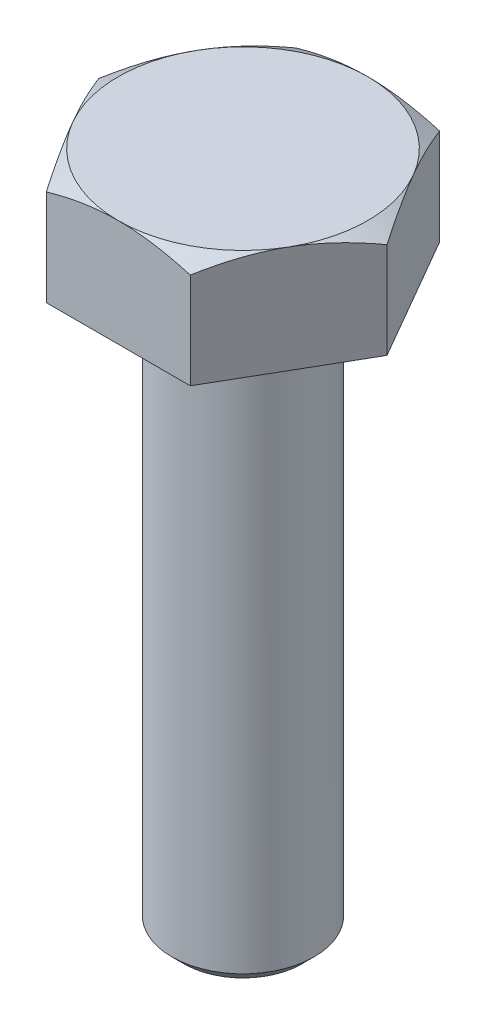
from build123d import *

# Parameters (mm, degrees)
BOSS_EXTRUDE1_DEPTH = 4.7752
SKETCH2_OUTSIDE_W   = 34.918
SKETCH2_OUTSIDE_H   = 33.198
SKETCH2_OUTSIDE_R   = 5.5626
CUT_EXTRUDE1_DEPTH  = 4.7752
CUT_EXTRUDE1_DRAFT  = -60
SKETCH3_R           = 3.175
BOSS_EXTRUDE2_DEPTH = 25.4
SKETCH4_OUTSIDE_W   = 72.572
SKETCH4_OUTSIDE_H   = 70.852
SKETCH4_OUTSIDE_R   = 2.633870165
CUT_EXTRUDE2_DEPTH  = 25.4
CUT_EXTRUDE2_DRAFT  = -45


with BuildPart() as part:
    # Sketch1 → Boss-Extrude1 (new body)
    with BuildSketch(Plane(origin=(0, 0, 0), x_dir=(1, 0, 0), z_dir=(0, 1, 0))):
        Polygon((6.423137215, 0), (3.211568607, 5.5626), (-3.211568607, 5.5626), (-6.423137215, 0), (-3.211568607, -5.5626), (3.211568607, -5.5626), align=None)
    extrude(amount=BOSS_EXTRUDE1_DEPTH)


with BuildPart() as cut_extrude1_tool:
    # Sketch2 outside → Cut-Extrude1 (with draft: the straight prism first)
    with BuildSketch(Plane(origin=(0, 4.7752, 0), x_dir=(1, 0, 0), z_dir=(0, 1, 0))):
        Rectangle(SKETCH2_OUTSIDE_W, SKETCH2_OUTSIDE_H)
        Circle(SKETCH2_OUTSIDE_R, mode=Mode.SUBTRACT)
    extrude(amount=-CUT_EXTRUDE1_DEPTH)
    # Cut-Extrude1: the draft: its side faces are tilted about the plane it starts from
    cut_extrude1_sides = [cut_extrude1_tool.faces().sort_by_distance(p)[0] for p in [
        (0, 2.3876, 16.599),
        (17.459, 2.3876, 0),
        (0, 2.3876, -16.599),
        (-17.459, 2.3876, 0),
        (-5.5626, 2.3876, 0),
    ]]
    draft(cut_extrude1_sides, Plane(origin=(0, 4.7752, 0), x_dir=(1, 0, 0), z_dir=(0, 1, 0)), CUT_EXTRUDE1_DRAFT)


with BuildPart() as part_1:
    add(part.part)

    # Cut-Extrude1: cut by cut_extrude1_tool
    add(cut_extrude1_tool.part, mode=Mode.SUBTRACT)

    # Sketch3 → Boss-Extrude2 (add)
    with BuildSketch(Plane.XZ):
        with Locations(Location((0, 0, 0), (0, 0, 90))):
            Circle(SKETCH3_R)
    extrude(amount=BOSS_EXTRUDE2_DEPTH)


with BuildPart() as cut_extrude2_tool:
    # Sketch4 outside → Cut-Extrude2 (with draft: the straight prism first)
    with BuildSketch(Plane.XZ.offset(25.4)):
        Rectangle(SKETCH4_OUTSIDE_W, SKETCH4_OUTSIDE_H)
        Circle(SKETCH4_OUTSIDE_R, mode=Mode.SUBTRACT)
    extrude(amount=-CUT_EXTRUDE2_DEPTH)
    # Cut-Extrude2: the draft: its side faces are tilted about the plane it starts from
    cut_extrude2_sides = [cut_extrude2_tool.faces().sort_by_distance(p)[0] for p in [
        (0, -12.7, -35.426),
        (36.286, -12.7, 0),
        (0, -12.7, 35.426),
        (-36.286, -12.7, 0),
        (-2.633870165, -12.7, 0),
    ]]
    draft(cut_extrude2_sides, Plane.XZ.offset(25.4), CUT_EXTRUDE2_DRAFT)


with BuildPart() as part_2:
    add(part_1.part)

    # Cut-Extrude2: cut by cut_extrude2_tool
    add(cut_extrude2_tool.part, mode=Mode.SUBTRACT)


solid = part_2.part
